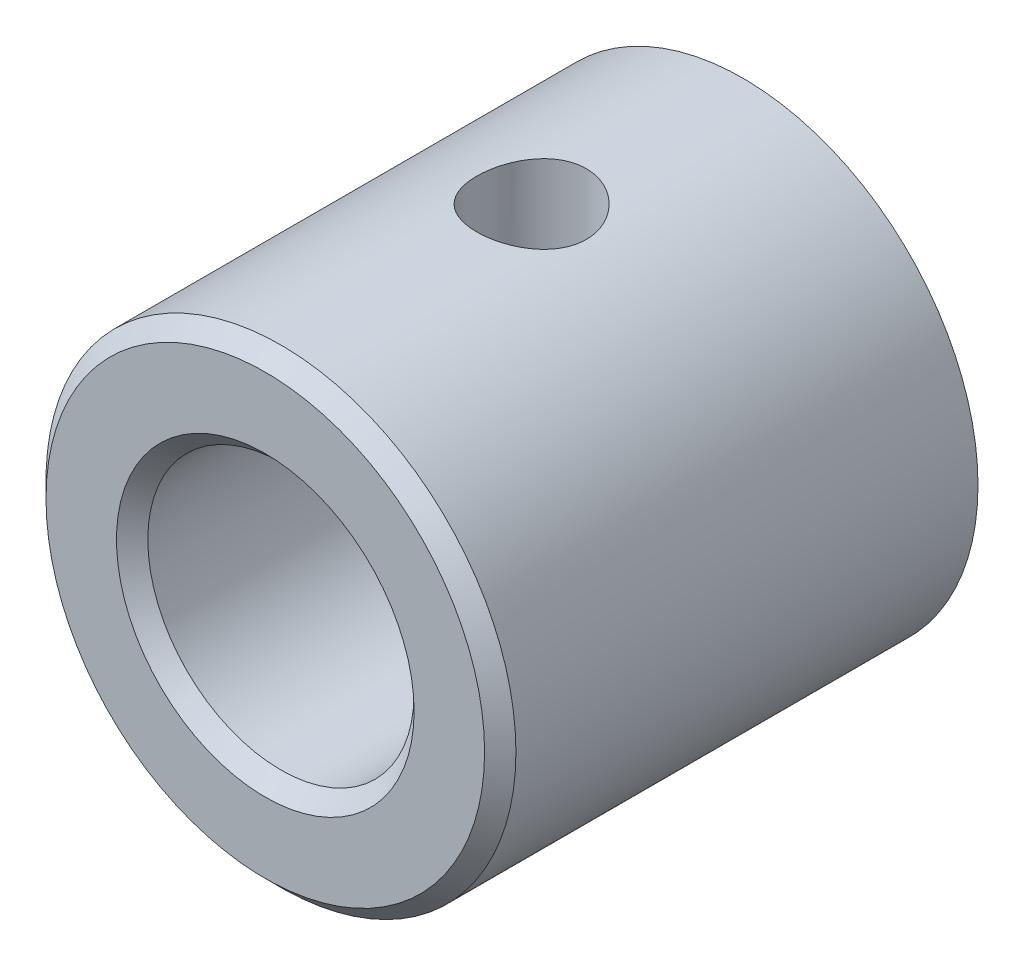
from build123d import *

# Parameters (mm, degrees)
ESQUISSE1_R             = 15
ESQUISSE1_R_2           = 8.5
EXTRUSION1_DEPTH        = 30.5
CHANFREIN1_SIZE         = 1
ESQUISSE2_R             = 3.5
ENL_V_MAT_EXTRU_1_DEPTH = 20


with BuildPart() as part:
    # Esquisse1 → Extrusion1 (new body)
    with BuildSketch(Plane.XY):
        with Locations(Location((0, 0, 0), (0, 0, 180))):
            Circle(ESQUISSE1_R)
        with Locations(Location((0, 0, 0), (0, 0, 180))):
            Circle(ESQUISSE1_R_2, mode=Mode.SUBTRACT)
    extrude(amount=EXTRUSION1_DEPTH)

    # Chanfrein1
    chanfrein1_edges = [part.edges().sort_by_distance(p)[0] for p in [
        (15, 0, 30.5),
        (8.5, 0, 30.5),
    ]]
    chamfer(chanfrein1_edges, length=CHANFREIN1_SIZE)

    # Esquisse2 → Enl_v. mat.-Extru.1 (cut, symmetric)
    with BuildSketch(Plane(origin=(0, 0, 0), x_dir=(1, 0, 0), z_dir=(0, 1, 0))):
        with Locations(Location((0, -13.5, 0), (0, 0, 270))):
            Circle(ESQUISSE2_R)
    extrude(amount=ENL_V_MAT_EXTRU_1_DEPTH, both=True, mode=Mode.SUBTRACT)


solid = part.part
